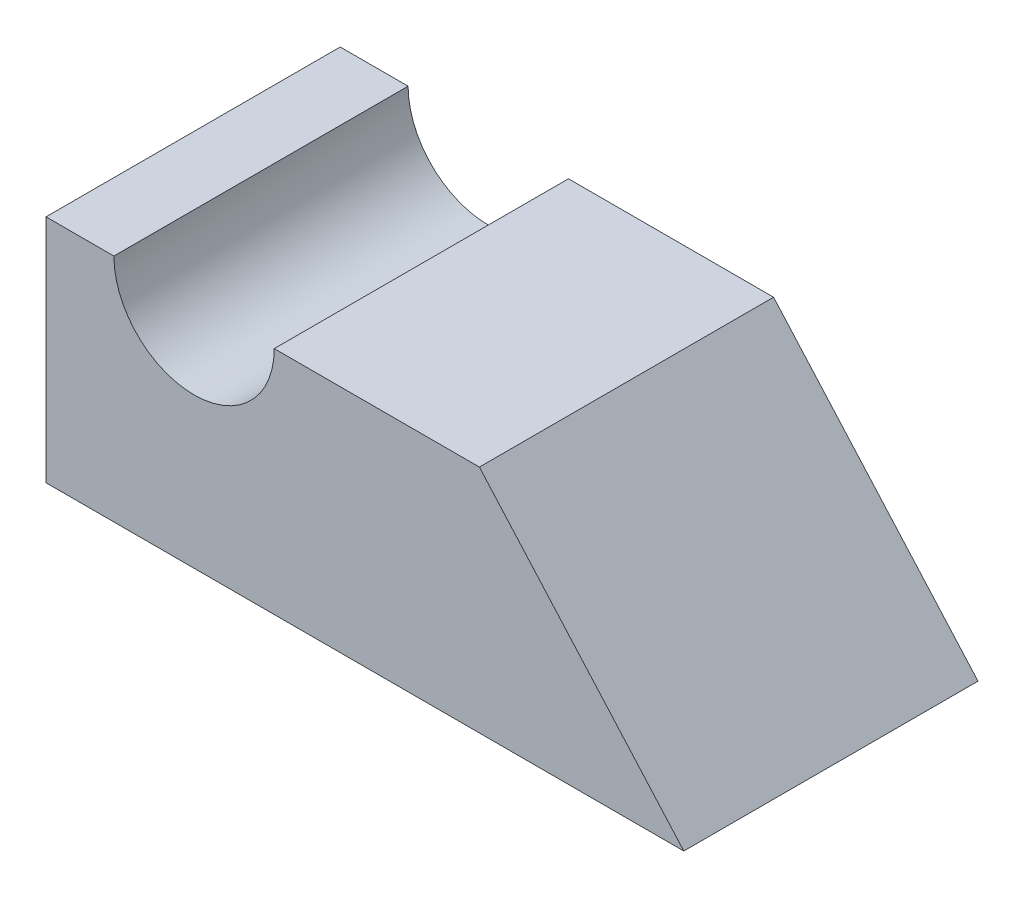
ISO-10303-21;
HEADER;
FILE_DESCRIPTION(('STEP AP214'),'2;1');
FILE_NAME('part.step','',(''),(''),'','','');
FILE_SCHEMA(('AUTOMOTIVE_DESIGN { 1 0 10303 214 1 1 1 1 }'));
ENDSEC;
DATA;
#1=APPLICATION_CONTEXT('core data for automotive mechanical design processes');
#2=APPLICATION_PROTOCOL_DEFINITION('international standard','automotive_design',2000,#1);
#3=PRODUCT_CONTEXT('',#1,'mechanical');
#4=PRODUCT('Part','Part','',(#3));
#5=PRODUCT_RELATED_PRODUCT_CATEGORY('part','',(#4));
#6=PRODUCT_DEFINITION_FORMATION('','',#4);
#7=PRODUCT_DEFINITION_CONTEXT('part definition',#1,'design');
#8=PRODUCT_DEFINITION('design','',#6,#7);
#9=PRODUCT_DEFINITION_SHAPE('','',#8);
#10=(LENGTH_UNIT() NAMED_UNIT(*) SI_UNIT(.MILLI.,.METRE.));
#11=(NAMED_UNIT(*) PLANE_ANGLE_UNIT() SI_UNIT($,.RADIAN.));
#12=(NAMED_UNIT(*) SI_UNIT($,.STERADIAN.) SOLID_ANGLE_UNIT());
#13=UNCERTAINTY_MEASURE_WITH_UNIT(LENGTH_MEASURE(1.E-05),#10,'distance_accuracy_value','');
#14=(GEOMETRIC_REPRESENTATION_CONTEXT(3) GLOBAL_UNCERTAINTY_ASSIGNED_CONTEXT((#13)) GLOBAL_UNIT_ASSIGNED_CONTEXT((#10,
#11,#12)) REPRESENTATION_CONTEXT('',''));
#15=CARTESIAN_POINT('',(0.,0.,0.));
#16=DIRECTION('',(0.,0.,1.));
#17=DIRECTION('',(1.,0.,0.));
#18=AXIS2_PLACEMENT_3D('',#15,#16,#17);
#19=CARTESIAN_POINT('',(-218.966289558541,0.,101.));
#20=DIRECTION('',(0.,1.,0.));
#21=DIRECTION('',(0.,0.,1.));
#22=AXIS2_PLACEMENT_3D('',#19,#20,#21);
#23=PLANE('',#22);
#24=DIRECTION('',(1.,0.,0.));
#25=VECTOR('',#24,1.);
#26=CARTESIAN_POINT('',(-218.966289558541,0.,0.));
#27=LINE('',#26,#25);
#28=CARTESIAN_POINT('',(-218.966289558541,0.,0.));
#29=VERTEX_POINT('',#28);
#30=CARTESIAN_POINT('',(0.,0.,0.));
#31=VERTEX_POINT('',#30);
#32=EDGE_CURVE('E115',#29,#31,#27,.T.);
#33=ORIENTED_EDGE('',*,*,#32,.T.);
#34=DIRECTION('',(0.,0.,-1.));
#35=VECTOR('',#34,1.);
#36=CARTESIAN_POINT('',(0.,0.,101.));
#37=LINE('',#36,#35);
#38=CARTESIAN_POINT('',(0.,0.,101.));
#39=VERTEX_POINT('',#38);
#40=EDGE_CURVE('E11',#39,#31,#37,.T.);
#41=ORIENTED_EDGE('',*,*,#40,.F.);
#42=DIRECTION('',(1.,0.,0.));
#43=VECTOR('',#42,1.);
#44=CARTESIAN_POINT('',(-218.966289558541,0.,101.));
#45=LINE('',#44,#43);
#46=CARTESIAN_POINT('',(-218.966289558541,0.,101.));
#47=VERTEX_POINT('',#46);
#48=EDGE_CURVE('E125',#47,#39,#45,.T.);
#49=ORIENTED_EDGE('',*,*,#48,.F.);
#50=DIRECTION('',(0.,0.,-1.));
#51=VECTOR('',#50,1.);
#52=CARTESIAN_POINT('',(-218.966289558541,0.,101.));
#53=LINE('',#52,#51);
#54=EDGE_CURVE('E111',#47,#29,#53,.T.);
#55=ORIENTED_EDGE('',*,*,#54,.T.);
#56=EDGE_LOOP('',(#33,#41,#49,#55));
#57=FACE_BOUND('',#56,.T.);
#58=ADVANCED_FACE('F31',(#57),#23,.F.);
#59=CARTESIAN_POINT('',(0.,0.,101.));
#60=DIRECTION('',(-0.747933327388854,-0.663773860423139,0.));
#61=DIRECTION('',(0.663773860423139,-0.747933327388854,0.));
#62=AXIS2_PLACEMENT_3D('',#59,#60,#61);
#63=PLANE('',#62);
#64=DIRECTION('',(-0.663773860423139,0.747933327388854,0.));
#65=VECTOR('',#64,1.);
#66=CARTESIAN_POINT('',(0.,0.,0.));
#67=LINE('',#66,#65);
#68=CARTESIAN_POINT('',(-70.1748796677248,79.0723081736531,0.));
#69=VERTEX_POINT('',#68);
#70=EDGE_CURVE('E118',#31,#69,#67,.T.);
#71=ORIENTED_EDGE('',*,*,#70,.T.);
#72=DIRECTION('',(0.,0.,-1.));
#73=VECTOR('',#72,1.);
#74=CARTESIAN_POINT('',(-70.1748796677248,79.0723081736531,101.));
#75=LINE('',#74,#73);
#76=CARTESIAN_POINT('',(-70.1748796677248,79.0723081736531,101.));
#77=VERTEX_POINT('',#76);
#78=EDGE_CURVE('E39',#77,#69,#75,.T.);
#79=ORIENTED_EDGE('',*,*,#78,.F.);
#80=DIRECTION('',(-0.663773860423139,0.747933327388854,0.));
#81=VECTOR('',#80,1.);
#82=CARTESIAN_POINT('',(0.,0.,101.));
#83=LINE('',#82,#81);
#84=EDGE_CURVE('E84',#39,#77,#83,.T.);
#85=ORIENTED_EDGE('',*,*,#84,.F.);
#86=ORIENTED_EDGE('',*,*,#40,.T.);
#87=EDGE_LOOP('',(#71,#79,#85,#86));
#88=FACE_BOUND('',#87,.T.);
#89=ADVANCED_FACE('F149',(#88),#63,.F.);
#90=CARTESIAN_POINT('',(-70.1748796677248,79.0723081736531,101.));
#91=DIRECTION('',(0.,-1.,0.));
#92=DIRECTION('',(0.,0.,-1.));
#93=AXIS2_PLACEMENT_3D('',#90,#91,#92);
#94=PLANE('',#93);
#95=DIRECTION('',(-1.,0.,0.));
#96=VECTOR('',#95,1.);
#97=CARTESIAN_POINT('',(-70.1748796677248,79.0723081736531,0.));
#98=LINE('',#97,#96);
#99=CARTESIAN_POINT('',(-140.604627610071,79.0723081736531,0.));
#100=VERTEX_POINT('',#99);
#101=EDGE_CURVE('E120',#69,#100,#98,.T.);
#102=ORIENTED_EDGE('',*,*,#101,.T.);
#103=DIRECTION('',(0.,0.,-1.));
#104=VECTOR('',#103,1.);
#105=CARTESIAN_POINT('',(-140.604627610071,79.0723081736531,101.));
#106=LINE('',#105,#104);
#107=CARTESIAN_POINT('',(-140.604627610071,79.0723081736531,101.));
#108=VERTEX_POINT('',#107);
#109=EDGE_CURVE('E106',#108,#100,#106,.T.);
#110=ORIENTED_EDGE('',*,*,#109,.F.);
#111=DIRECTION('',(-1.,0.,0.));
#112=VECTOR('',#111,1.);
#113=CARTESIAN_POINT('',(-70.1748796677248,79.0723081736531,101.));
#114=LINE('',#113,#112);
#115=EDGE_CURVE('E97',#77,#108,#114,.T.);
#116=ORIENTED_EDGE('',*,*,#115,.F.);
#117=ORIENTED_EDGE('',*,*,#78,.T.);
#118=EDGE_LOOP('',(#102,#110,#116,#117));
#119=FACE_BOUND('',#118,.T.);
#120=ADVANCED_FACE('F131',(#119),#94,.F.);
#121=CARTESIAN_POINT('',(-168.130401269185,79.0723081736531,101.));
#122=DIRECTION('',(0.,0.,-1.));
#123=DIRECTION('',(-1.,0.,0.));
#124=AXIS2_PLACEMENT_3D('',#121,#122,#123);
#125=CYLINDRICAL_SURFACE('',#124,27.5257736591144);
#126=CARTESIAN_POINT('',(-168.130401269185,79.0723081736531,0.));
#127=DIRECTION('',(0.,0.,-1.));
#128=DIRECTION('',(1.,0.,0.));
#129=AXIS2_PLACEMENT_3D('',#126,#127,#128);
#130=CIRCLE('',#129,27.5257736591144);
#131=CARTESIAN_POINT('',(-195.6561749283,79.0723081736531,0.));
#132=VERTEX_POINT('',#131);
#133=EDGE_CURVE('E105',#100,#132,#130,.T.);
#134=ORIENTED_EDGE('',*,*,#133,.T.);
#135=DIRECTION('',(0.,0.,-1.));
#136=VECTOR('',#135,1.);
#137=CARTESIAN_POINT('',(-195.6561749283,79.0723081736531,101.));
#138=LINE('',#137,#136);
#139=CARTESIAN_POINT('',(-195.6561749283,79.0723081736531,101.));
#140=VERTEX_POINT('',#139);
#141=EDGE_CURVE('E102',#140,#132,#138,.T.);
#142=ORIENTED_EDGE('',*,*,#141,.F.);
#143=CARTESIAN_POINT('',(-168.130401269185,79.0723081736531,101.));
#144=DIRECTION('',(0.,0.,-1.));
#145=DIRECTION('',(1.,0.,0.));
#146=AXIS2_PLACEMENT_3D('',#143,#144,#145);
#147=CIRCLE('',#146,27.5257736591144);
#148=EDGE_CURVE('E91',#108,#140,#147,.T.);
#149=ORIENTED_EDGE('',*,*,#148,.F.);
#150=ORIENTED_EDGE('',*,*,#109,.T.);
#151=EDGE_LOOP('',(#134,#142,#149,#150));
#152=FACE_BOUND('',#151,.T.);
#153=ADVANCED_FACE('F103',(#152),#125,.F.);
#154=CARTESIAN_POINT('',(-195.6561749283,79.0723081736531,101.));
#155=DIRECTION('',(0.,-1.,0.));
#156=DIRECTION('',(0.,0.,-1.));
#157=AXIS2_PLACEMENT_3D('',#154,#155,#156);
#158=PLANE('',#157);
#159=DIRECTION('',(-1.,0.,0.));
#160=VECTOR('',#159,1.);
#161=CARTESIAN_POINT('',(-195.6561749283,79.0723081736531,0.));
#162=LINE('',#161,#160);
#163=CARTESIAN_POINT('',(-218.966289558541,79.0723081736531,0.));
#164=VERTEX_POINT('',#163);
#165=EDGE_CURVE('E70',#132,#164,#162,.T.);
#166=ORIENTED_EDGE('',*,*,#165,.T.);
#167=DIRECTION('',(0.,0.,-1.));
#168=VECTOR('',#167,1.);
#169=CARTESIAN_POINT('',(-218.966289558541,79.0723081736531,101.));
#170=LINE('',#169,#168);
#171=CARTESIAN_POINT('',(-218.966289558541,79.0723081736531,101.));
#172=VERTEX_POINT('',#171);
#173=EDGE_CURVE('E107',#172,#164,#170,.T.);
#174=ORIENTED_EDGE('',*,*,#173,.F.);
#175=DIRECTION('',(-1.,0.,0.));
#176=VECTOR('',#175,1.);
#177=CARTESIAN_POINT('',(-195.6561749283,79.0723081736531,101.));
#178=LINE('',#177,#176);
#179=EDGE_CURVE('E95',#140,#172,#178,.T.);
#180=ORIENTED_EDGE('',*,*,#179,.F.);
#181=ORIENTED_EDGE('',*,*,#141,.T.);
#182=EDGE_LOOP('',(#166,#174,#180,#181));
#183=FACE_BOUND('',#182,.T.);
#184=ADVANCED_FACE('F109',(#183),#158,.F.);
#185=CARTESIAN_POINT('',(-218.966289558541,79.0723081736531,101.));
#186=DIRECTION('',(1.,0.,0.));
#187=DIRECTION('',(0.,0.,-1.));
#188=AXIS2_PLACEMENT_3D('',#185,#186,#187);
#189=PLANE('',#188);
#190=DIRECTION('',(0.,-1.,0.));
#191=VECTOR('',#190,1.);
#192=CARTESIAN_POINT('',(-218.966289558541,79.0723081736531,0.));
#193=LINE('',#192,#191);
#194=EDGE_CURVE('E76',#164,#29,#193,.T.);
#195=ORIENTED_EDGE('',*,*,#194,.T.);
#196=ORIENTED_EDGE('',*,*,#54,.F.);
#197=DIRECTION('',(0.,-1.,0.));
#198=VECTOR('',#197,1.);
#199=CARTESIAN_POINT('',(-218.966289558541,79.0723081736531,101.));
#200=LINE('',#199,#198);
#201=EDGE_CURVE('E47',#172,#47,#200,.T.);
#202=ORIENTED_EDGE('',*,*,#201,.F.);
#203=ORIENTED_EDGE('',*,*,#173,.T.);
#204=EDGE_LOOP('',(#195,#196,#202,#203));
#205=FACE_BOUND('',#204,.T.);
#206=ADVANCED_FACE('F138',(#205),#189,.F.);
#207=CARTESIAN_POINT('',(-168.130401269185,79.0723081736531,101.));
#208=DIRECTION('',(0.,0.,1.));
#209=DIRECTION('',(1.,0.,0.));
#210=AXIS2_PLACEMENT_3D('',#207,#208,#209);
#211=PLANE('',#210);
#212=ORIENTED_EDGE('',*,*,#48,.T.);
#213=ORIENTED_EDGE('',*,*,#84,.T.);
#214=ORIENTED_EDGE('',*,*,#115,.T.);
#215=ORIENTED_EDGE('',*,*,#148,.T.);
#216=ORIENTED_EDGE('',*,*,#179,.T.);
#217=ORIENTED_EDGE('',*,*,#201,.T.);
#218=EDGE_LOOP('',(#212,#213,#214,#215,#216,#217));
#219=FACE_BOUND('',#218,.T.);
#220=ADVANCED_FACE('F93',(#219),#211,.T.);
#221=CARTESIAN_POINT('',(-168.130401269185,79.0723081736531,0.));
#222=DIRECTION('',(0.,0.,1.));
#223=DIRECTION('',(1.,0.,0.));
#224=AXIS2_PLACEMENT_3D('',#221,#222,#223);
#225=PLANE('',#224);
#226=ORIENTED_EDGE('',*,*,#32,.F.);
#227=ORIENTED_EDGE('',*,*,#194,.F.);
#228=ORIENTED_EDGE('',*,*,#165,.F.);
#229=ORIENTED_EDGE('',*,*,#133,.F.);
#230=ORIENTED_EDGE('',*,*,#101,.F.);
#231=ORIENTED_EDGE('',*,*,#70,.F.);
#232=EDGE_LOOP('',(#226,#227,#228,#229,#230,#231));
#233=FACE_BOUND('',#232,.T.);
#234=ADVANCED_FACE('F134',(#233),#225,.F.);
#235=CLOSED_SHELL('',(#58,#89,#120,#153,#184,#206,#220,#234));
#236=MANIFOLD_SOLID_BREP('B2',#235);
#237=ADVANCED_BREP_SHAPE_REPRESENTATION('',(#18,#236),#14);
#238=SHAPE_DEFINITION_REPRESENTATION(#9,#237);
ENDSEC;
END-ISO-10303-21;
